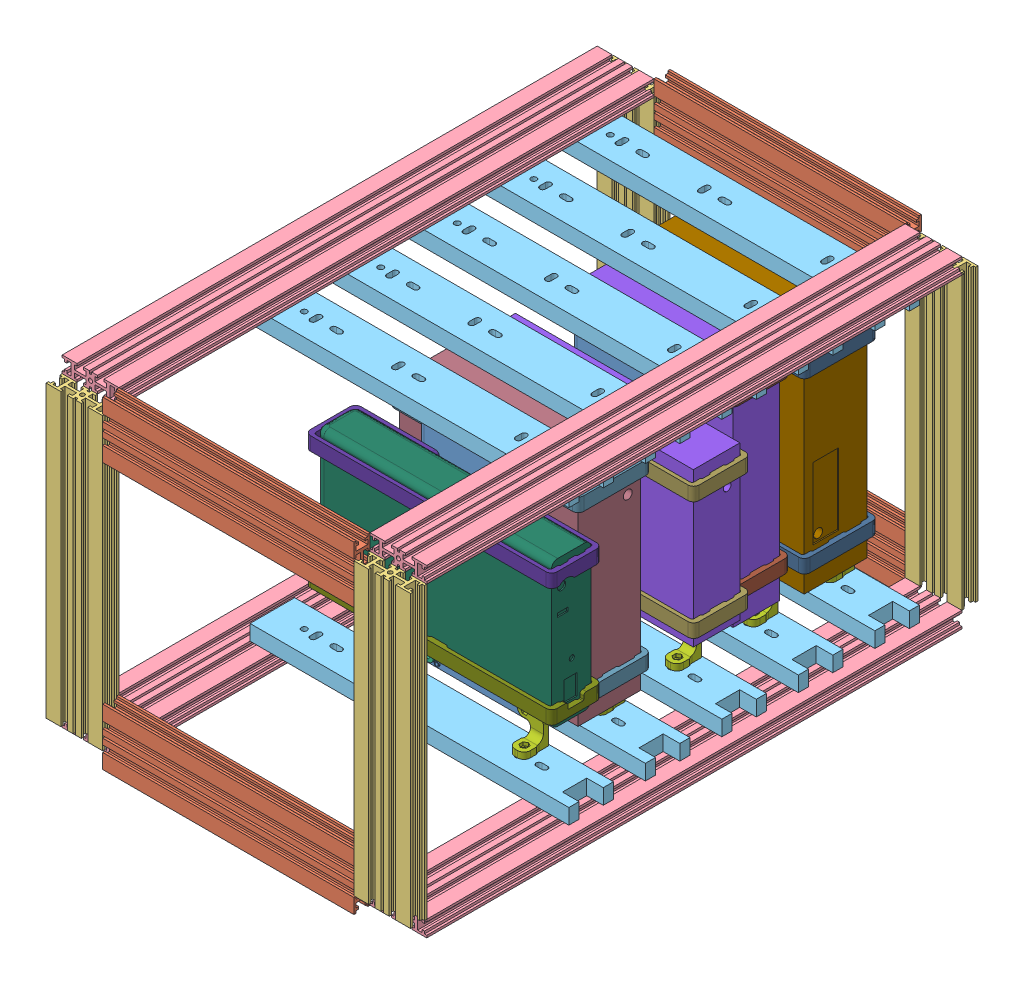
SolidWorks assembly Full ASM of Blades.SLDASM, configuration Default (file format 9000). Lengths in mm.
Overall size (285.9 253 445).
63 component instances, 17 part files, 57 mates.
Components (placement in the parent):
- Hard Fixer Panel-1: Hard Fixer Panel.SLDPRT [Default] at (220.273 500.4247 60.2249) x (-1 0 0) z (0 0 -1) size (90.2 192.2 2.2)
- Blades ASM-2: Blades ASM.SLDASM [Default] at (236.5165 485.0779 574.7555) x (0 0 -1) z (1 0 0) size (445 253 285.9)
  - Blade1-1: Blade1.SLDPRT [Default] at (114.7807 102.2962 48.6134) x (0 1 0) z (0 0 -1) size (44.45 12.7 197)
  - Blade2-1: Blade2.SLDPRT [Default] at (114.7807 111.8212 -170.6116) x (0 0 -1) z (0 -1 0) size (44.45 12.7 227.6)
  - Blade3-2: Blade3.SLDPRT [Default] at (121.1307 -122.1288 -170.6116) x (0 0 -1) z (1 0 0) size (44.45 12.7 419.6)
  - Blade3-6: Blade3.SLDPRT [Default] at (121.1307 118.1712 -170.6116) x (0 0 -1) z (1 0 0) size (44.45 12.7 419.6)
  - Blade3-7: Blade3.SLDPRT [Default] at (121.1307 -122.1288 70.8384) x (0 0 -1) z (1 0 0) size (44.45 12.7 419.6)
  - Blade3-8: Blade3.SLDPRT [Default] at (121.1307 118.1712 70.8384) x (0 0 -1) z (1 0 0) size (44.45 12.7 419.6)
  - Blade1-2: Blade1.SLDPRT [Default] at (114.7807 -106.2538 48.6134) x (0 1 0) z (0 0 -1) size (44.45 12.7 197)
  - Blade1-3: Blade1.SLDPRT [Default] at (547.0807 -106.2538 48.6134) x (0 1 0) z (0 0 -1) size (44.45 12.7 197)
  - Blade1-4: Blade1.SLDPRT [Default] at (547.0807 102.2962 48.6134) x (0 1 0) z (0 0 -1) size (44.45 12.7 197)
  - Blade2-2: Blade2.SLDPRT [Default] at (547.0807 111.8212 -170.6116) x (0 0 -1) z (0 -1 0) size (44.45 12.7 227.6)
  - Blade2-3: Blade2.SLDPRT [Default] at (114.7807 111.8212 70.8384) x (0 0 -1) z (0 -1 0) size (44.45 12.7 227.6)
  - Blade2-4: Blade2.SLDPRT [Default] at (547.0807 111.8212 70.8384) x (0 0 -1) z (0 -1 0) size (44.45 12.7 227.6)
- Rail 250-1: Rail 250.SLDPRT [Default] at (92.9686 596.8991 73.5754) x (0 0 -1) z (0 -1 0) size (35 250 12)
- Rail 250-11: Rail 250.SLDPRT [Default] at (92.9686 369.2991 79.4743) x (0 0 1) z (0 1 0) size (35 250 12)
- Panel Fixer (on rail)Part1-1: Panel Fixer (on rail)Part1.SLDPRT [Default] at (273.0864 578.6645 60.2249) size (21.2 24 20.23)
- Panel Fixer (on rail)Part1-12: Panel Fixer (on rail)Part1.SLDPRT [Default] at (163.6234 387.5337 60.2249) x (-1 0 0) z (0 0 1) size (21.2 24 20.23)
- Panel Fixer (on rail)Part2-1: Panel Fixer (on rail)Part2.SLDPRT [Default] at (176.5864 578.6645 60.2249) size (21.2 24 20.23)
- Panel Fixer (on rail)Part2-11: Panel Fixer (on rail)Part2.SLDPRT [Default] at (260.1234 387.5337 60.2249) x (-1 0 0) z (0 0 1) size (21.2 24 20.23)
- Seagate Black-1: Seagate Black.SLDPRT [Default] at (179.8327 395.0991 139.9442) x (-1 0 0) z (0 1 0) size (120.5 36.5 176)
- WD White-3T-1: WD White-3T.SLDPRT [Default] at (177.4105 398.5991 89.1799) x (-1 0 0) z (0 1 0) size (138.5 49.4 169)
- WD-3T-Part1-1: WD-3T-Part1.SLDPRT [Default] at (168.9075 510.4825 114.2249) size (146.8 10.6 58)
- Panel Fixer (on rail)Part1-13: Panel Fixer (on rail)Part1.SLDPRT [Default] at (163.6234 387.5337 120.2249) x (-1 0 0) z (0 0 1) size (21.2 24 20.23)
- Panel Fixer (on rail)Part2-12: Panel Fixer (on rail)Part2.SLDPRT [Default] at (260.1234 387.5337 120.2249) x (-1 0 0) z (0 0 1) size (21.2 24 20.23)
- Hard Fixer Panel-2: Hard Fixer Panel.SLDPRT [Default] at (220.273 500.4247 120.2249) x (-1 0 0) z (0 0 -1) size (90.2 192.2 2.2)
- Panel Fixer (on rail)Part2-4: Panel Fixer (on rail)Part2.SLDPRT [Default] at (176.5864 578.6645 120.2249) size (21.2 24 20.23)
- Panel Fixer (on rail)Part1-5: Panel Fixer (on rail)Part1.SLDPRT [Default] at (273.0864 578.6645 120.2249) size (21.2 24 20.23)
- Rail 250-12: Rail 250.SLDPRT [Default] at (92.9686 369.2991 139.4743) x (0 0 1) z (0 1 0) size (35 250 12)
- Rail 250-4: Rail 250.SLDPRT [Default] at (92.9686 596.8991 133.5754) x (0 0 -1) z (0 -1 0) size (35 250 12)
- Seagate-3T-Fixer Part1-1: Seagate-3T-Fixer Part1.SLDPRT [Default] at (160.1075 510.4825 161.2249) size (128.8 10.6 45)
- WD-3T-Part1-2: WD-3T-Part1.SLDPRT [Default] at (168.9075 377.8825 114.2249) size (146.8 10.6 58)
- Seagate-3T-Fixer Part1-2: Seagate-3T-Fixer Part1.SLDPRT [Default] at (160.1075 377.8825 161.2249) size (128.8 10.6 45)
- Rail 250-5: Rail 250.SLDPRT [Default] at (92.9686 596.8991 193.5754) x (0 0 -1) z (0 -1 0) size (35 250 12)
- Rail 250-13: Rail 250.SLDPRT [Default] at (92.9686 369.2991 199.4743) x (0 0 1) z (0 1 0) size (35 250 12)
- Panel Fixer (on rail)Part1-6: Panel Fixer (on rail)Part1.SLDPRT [Default] at (273.0864 578.6645 180.2249) size (21.2 24 20.23)
- Panel Fixer (on rail)Part2-5: Panel Fixer (on rail)Part2.SLDPRT [Default] at (176.5864 578.6645 180.2249) size (21.2 24 20.23)
- Hard Fixer Panel-3: Hard Fixer Panel.SLDPRT [Default] at (220.273 500.4247 180.2249) x (-1 0 0) z (0 0 -1) size (90.2 192.2 2.2)
- Panel Fixer (on rail)Part2-13: Panel Fixer (on rail)Part2.SLDPRT [Default] at (260.1234 387.5337 180.2249) x (-1 0 0) z (0 0 1) size (21.2 24 20.23)
- Panel Fixer (on rail)Part1-14: Panel Fixer (on rail)Part1.SLDPRT [Default] at (163.6234 387.5337 180.2249) x (-1 0 0) z (0 0 1) size (21.2 24 20.23)
- Seagate Black-2: Seagate Black.SLDPRT [Default] at (306.3411 449.2769 200.0442) x (0 -1 0) z (-1 0 0) size (120.5 36.5 176)
- Seagate-3T-Fixer Part2-1: Seagate-3T-Fixer Part2.SLDPRT [Default] at (189.0438 490.4825 221.2249) size (184.2 10.6 45)
- Seagate-3T-Fixer Part2-2: Seagate-3T-Fixer Part2.SLDPRT [Default] at (189.0438 397.6825 221.2249) size (184.2 10.6 45)
- Panel Fixer (on rail)Part1-15: Panel Fixer (on rail)Part1.SLDPRT [Default] at (163.6234 387.5337 240.2249) x (-1 0 0) z (0 0 1) size (21.2 24 20.23)
- Panel Fixer (on rail)Part1-16: Panel Fixer (on rail)Part1.SLDPRT [Default] at (163.6234 387.5337 300.2249) x (-1 0 0) z (0 0 1) size (21.2 24 20.23)
- Panel Fixer (on rail)Part2-14: Panel Fixer (on rail)Part2.SLDPRT [Default] at (260.1234 387.5337 240.2249) x (-1 0 0) z (0 0 1) size (21.2 24 20.23)
- Panel Fixer (on rail)Part2-15: Panel Fixer (on rail)Part2.SLDPRT [Default] at (260.1234 387.5337 300.2249) x (-1 0 0) z (0 0 1) size (21.2 24 20.23)
- Hard Fixer Panel-4: Hard Fixer Panel.SLDPRT [Default] at (220.273 500.4247 240.2249) x (-1 0 0) z (0 0 -1) size (90.2 192.2 2.2)
- Hard Fixer Panel-5: Hard Fixer Panel.SLDPRT [Default] at (220.273 500.4247 300.2249) x (-1 0 0) z (0 0 -1) size (90.2 192.2 2.2)
- Panel Fixer (on rail)Part2-9: Panel Fixer (on rail)Part2.SLDPRT [Default] at (176.5864 578.6645 240.2249) size (21.2 24 20.23)
- Panel Fixer (on rail)Part2-10: Panel Fixer (on rail)Part2.SLDPRT [Default] at (176.5864 578.6645 300.2249) size (21.2 24 20.23)
- Panel Fixer (on rail)Part1-10: Panel Fixer (on rail)Part1.SLDPRT [Default] at (273.0864 578.6645 240.2249) size (21.2 24 20.23)
- Panel Fixer (on rail)Part1-11: Panel Fixer (on rail)Part1.SLDPRT [Default] at (273.0864 578.6645 300.2249) size (21.2 24 20.23)
- Rail 250-14: Rail 250.SLDPRT [Default] at (92.9686 369.2991 259.4743) x (0 0 1) z (0 1 0) size (35 250 12)
- Rail 250-15: Rail 250.SLDPRT [Default] at (92.9686 369.2991 319.4743) x (0 0 1) z (0 1 0) size (35 250 12)
- Rail 250-9: Rail 250.SLDPRT [Default] at (92.9686 596.8991 253.5754) x (0 0 -1) z (0 -1 0) size (35 250 12)
- Rail 250-10: Rail 250.SLDPRT [Default] at (92.9686 596.8991 313.5754) x (0 0 -1) z (0 -1 0) size (35 250 12)
- WD Black Hard-1: WD Black Hard.SLDPRT [Default] at (248.0955 567.7557 263.9626) x (1 0 0) z (0 -1 0) size (140 49 168)
- WD Black Hard-Fixer Part1-1: WD Black Hard-Fixer Part1.SLDPRT [Default] at (171.1075 377.6825 293.8249) size (148.4 10.6 57.6)
- ROYAL ex box-1: ROYAL ex box.SLDPRT [Default] at (230.3502 481.5972 304.8249) size (185.37 114 31.73)
- WD Black Hard-Fixer Part1-2: WD Black Hard-Fixer Part1.SLDPRT [Default] at (171.1075 510.4825 293.8249) size (148.4 10.6 57.6)
- Royal ex-Part1-1: Royal ex-Part1.SLDPRT [Default] at (192.3075 397.6825 335.8249) size (193.4 10.6 39.6)
- Royal ex-Part2-1: Royal ex-Part2.SLDPRT [Default] at (192.3075 490.4825 335.8249) size (193.4 10.6 39.6)
Mates (geometry in assembly coordinates):
- Coincident1: coincident: line of Blades ASM-2/Blade3-6 through (71.4049 596.8991 34.0249) axis (0 0 1); plane of Rail 250-1 through (71.4049 584.8991 94.0249) normal (-1 0 0)
- Coincident2: coincident anti-aligned: plane of Blades ASM-2/Blade3-6 through (88.1299 596.8991 34.0249) normal (0 -1 0); plane of Rail 250-1 through (92.9686 596.8991 73.5754) normal (0 1 0)
- Coincident3: coincident aligned: plane of Rail 250-1 through (71.4049 584.8991 94.0249) normal (-1 0 0); plane of Rail 250-11 through (71.4049 381.2991 59.0249) normal (-1 0 0)
- Coincident4: coincident aligned: plane of Rail 250-1 through (321.4049 584.8991 94.0249) normal (0 0 1); plane of Rail 250-11 through (321.4049 381.2991 94.0249) normal (0 0 1)
- Coincident5: coincident anti-aligned: plane of Blades ASM-2/Blade3-2 through (76.5049 369.2991 34.0249) normal (0 1 0); plane of Rail 250-11 through (92.9686 369.2991 79.4743) normal (0 -1 0)
- Coincident6: coincident aligned: plane of Hard Fixer Panel-1 through (220.273 500.4247 59.0249) normal (0 0 -1); plane of Rail 250-1 through (321.4049 584.8991 59.0249) normal (0 0 -1)
- Distance1: distance = 25 mm anti-aligned: plane of Blades ASM-2/Blade2-2 through (88.1299 369.2991 34.0249) normal (0 0 1); plane of Rail 250-1 through (321.4049 584.8991 59.0249) normal (0 0 -1)
- Coincident7: coincident anti-aligned: plane of Hard Fixer Panel-1 through (220.273 500.4247 60.2249) normal (0 0 1); plane of Panel Fixer (on rail)Part1-1 through (273.0864 578.6645 60.2249) normal (0 0 -1)
- Coincident8: coincident anti-aligned: plane of Rail 250-1 through (92.9686 584.8991 73.5754) normal (0 -1 0); plane of Panel Fixer (on rail)Part1-1 through (261.6049 584.8991 64.2249) normal (0 1 0)
- Distance2: distance = 5 mm: plane of Panel Fixer (on rail)Part1-1 through (261.6049 584.8991 64.2249) normal (-1 0 0); point of Rail 250-1
- Coincident11: coincident anti-aligned: plane of Rail 250-11 through (92.9686 381.2991 79.4743) normal (0 1 0); plane of Panel Fixer (on rail)Part1-12 through (175.1049 381.2991 64.2249) normal (0 -1 0)
- Coincident12: coincident anti-aligned: plane of Hard Fixer Panel-1 through (220.273 500.4247 60.2249) normal (0 0 1); plane of Panel Fixer (on rail)Part1-12 through (163.6234 387.5337 60.2249) normal (0 0 -1)
- Distance4: distance = 5 mm: point of Rail 250-11; plane of Panel Fixer (on rail)Part1-12 through (175.1049 381.2991 64.2249) normal (1 0 0)
- Distance6: distance = 18.9 mm: point of Hard Fixer Panel-1; plane of Rail 250-1 through (92.9686 584.8991 73.5754) normal (0 -1 0)
- Parallel1: parallel aligned: plane of Hard Fixer Panel-1 through (262.1049 582.9991 59.0249) normal (1 0 0); plane of Rail 250-1 through (321.4049 584.8991 94.0249) normal (1 0 0)
- Distance9: distance = 4.9 mm: plane of Panel Fixer (on rail)Part1-1 through (261.6049 584.8991 64.2249) normal (-1 0 0); point of Hard Fixer Panel-1
- Coincident13: coincident anti-aligned: plane of Rail 250-1 through (92.9686 584.8991 73.5754) normal (0 -1 0); plane of Panel Fixer (on rail)Part2-1 through (165.1049 584.8991 64.2249) normal (0 1 0)
- Coincident14: coincident anti-aligned: plane of Hard Fixer Panel-1 through (220.273 500.4247 60.2249) normal (0 0 1); plane of Panel Fixer (on rail)Part2-1 through (176.5864 578.6645 60.2249) normal (0 0 -1)
- Distance10: distance = 5 mm: point of Rail 250-1; plane of Panel Fixer (on rail)Part2-1 through (165.1049 584.8991 64.2249) normal (-1 0 0)
- Coincident15: coincident anti-aligned: plane of Rail 250-11 through (92.9686 381.2991 79.4743) normal (0 1 0); plane of Panel Fixer (on rail)Part2-11 through (271.6049 381.2991 64.2249) normal (0 -1 0)
- Coincident16: coincident anti-aligned: plane of Hard Fixer Panel-1 through (220.273 500.4247 60.2249) normal (0 0 1); plane of Panel Fixer (on rail)Part2-11 through (260.1234 387.5337 60.2249) normal (0 0 -1)
- Distance11: distance = 5 mm: plane of Panel Fixer (on rail)Part2-11 through (271.6049 381.2991 64.2249) normal (1 0 0); point of Rail 250-11
- Distance12: distance = 17.3 mm anti-aligned: plane of WD White-3T-1 through (177.4105 398.5991 89.1799) normal (0 -1 0); plane of Rail 250-11 through (92.9686 381.2991 79.4743) normal (0 1 0)
- Distance13: distance = 24 mm aligned: plane of WD White-3T-1 through (286.1049 567.5991 114.2249) normal (1 0 0); plane of Hard Fixer Panel-1 through (262.1049 582.9991 59.0249) normal (1 0 0)
- Coincident21: coincident anti-aligned: plane of WD White-3T-1 through (286.1049 567.5991 114.2249) normal (0 0 1); plane of WD-3T-Part1-1 through (168.9075 510.4825 114.2249) normal (0 0 -1)
- Distance15: distance = 4.2 mm aligned: plane of WD-3T-Part1-1 through (290.3049 558.2991 118.2249) normal (1 0 0); plane of WD White-3T-1 through (286.1049 567.5991 114.2249) normal (1 0 0)
- Coincident24: coincident anti-aligned: plane of Hard Fixer Panel-1 through (220.273 500.4247 60.2249) normal (0 0 1); plane of WD-3T-Part1-1 through (168.9075 510.4825 60.2249) normal (0 0 -1)
- Distance18: distance = 13.8 mm anti-aligned: plane of Seagate Black-1 through (179.8327 571.0991 139.9442) normal (0 1 0); plane of Rail 250-4 through (92.9686 584.8991 133.5754) normal (0 -1 0)
- Distance19: distance = 15 mm aligned: plane of Seagate Black-1 through (156.9049 571.0991 161.2249) normal (-1 0 0); plane of Hard Fixer Panel-2 through (171.9049 582.9991 119.0249) normal (-1 0 0)
- Distance20: distance = 24.7 mm aligned: plane of Hard Fixer Panel-1 through (262.1049 582.9991 59.0249) normal (0 1 0); plane of WD-3T-Part1-1 through (143.5049 558.2991 118.2249) normal (0 1 0)
- Coincident25: coincident aligned: plane of WD-3T-Part1-1 through (143.5049 558.2991 118.2249) normal (0 1 0); plane of Seagate-3T-Fixer Part1-1 through (152.7049 558.2991 165.2249) normal (0 1 0)
- Coincident26: coincident anti-aligned: plane of Hard Fixer Panel-2 through (220.273 500.4247 120.2249) normal (0 0 1); plane of Seagate-3T-Fixer Part1-1 through (160.1075 510.4825 120.2249) normal (0 0 -1)
- Coincident27: coincident anti-aligned: plane of Seagate Black-1 through (277.4049 571.0991 161.2249) normal (0 0 1); plane of Seagate-3T-Fixer Part1-1 through (160.1075 510.4825 161.2249) normal (0 0 -1)
- Distance21: distance = 0.1 mm anti-aligned: plane of Seagate Black-1 through (277.4049 571.0991 161.2249) normal (1 0 0); plane of Seagate-3T-Fixer Part1-1 through (277.5049 547.6991 120.2249) normal (-1 0 0)
- Coincident28: coincident anti-aligned: plane of Hard Fixer Panel-3 through (220.273 500.4247 180.2249) normal (0 0 1); plane of Seagate-3T-Fixer Part2-1 through (189.0438 490.4825 180.2249) normal (0 0 -1)
- Concentric1: concentric anti-aligned: circle of Hard Fixer Panel-3; circle of Seagate-3T-Fixer Part2-1
- Distance22: distance = 0.2 mm anti-aligned: plane of Seagate Black-2 through (130.3411 546.8491 184.8249) normal (0 0 -1); plane of Seagate-3T-Fixer Part2-1 through (130.2411 527.6991 184.6249) normal (0 0 1)
- Distance24: distance = 0.1 mm anti-aligned: plane of Seagate Black-2 through (130.3411 449.2769 200.0442) normal (-1 0 0); plane of Seagate-3T-Fixer Part2-1 through (130.2411 527.6991 180.2249) normal (1 0 0)
- Parallel2: parallel aligned: plane of Rail 250-5 through (92.9686 596.8991 193.5754) normal (0 1 0); plane of Seagate-3T-Fixer Part2-1 through (126.2411 538.2991 225.2249) normal (0 1 0)
- Coincident29: coincident aligned: plane of Seagate-3T-Fixer Part2-1 through (189.0438 490.4825 225.2249) normal (0 0 1); plane of Seagate-3T-Fixer Part2-2 through (189.0438 397.6825 225.2249) normal (0 0 1)
- Coincident30: coincident aligned: plane of Seagate-3T-Fixer Part2-1 through (126.2411 538.2991 225.2249) normal (-1 0 0); plane of Seagate-3T-Fixer Part2-2 through (126.2411 445.4991 225.2249) normal (-1 0 0)
- Concentric2: concentric aligned: circle of Hard Fixer Panel-3; circle of Seagate-3T-Fixer Part2-2
- Distance25: distance = 8.55 mm aligned: plane of Seagate Black-2 through (130.3411 546.8491 221.3249) normal (0 1 0); plane of Seagate-3T-Fixer Part2-1 through (126.2411 538.2991 225.2249) normal (0 1 0)
- Distance26: distance = 0.2 mm anti-aligned: plane of WD Black Hard-Fixer Part1-1 through (288.5049 414.8991 244.6249) normal (0 0 1); plane of WD Black Hard-1 through (148.4049 399.7557 244.8249) normal (0 0 -1)
- Distance27: distance = 0.1 mm anti-aligned: plane of WD Black Hard-1 through (288.4049 399.7557 293.8249) normal (1 0 0); plane of WD Black Hard-Fixer Part1-1 through (288.5049 414.8991 240.2249) normal (-1 0 0)
- Concentric3: concentric aligned: circle of Hard Fixer Panel-4; circle of WD Black Hard-Fixer Part1-1
- Coincident31: coincident anti-aligned: plane of Hard Fixer Panel-4 through (220.273 500.4247 240.2249) normal (0 0 1); plane of WD Black Hard-Fixer Part1-1 through (171.1075 377.6825 240.2249) normal (0 0 -1)
- Coincident32: coincident anti-aligned: plane of Hard Fixer Panel-4 through (220.273 500.4247 240.2249) normal (0 0 1); plane of WD Black Hard-Fixer Part1-1 through (171.1075 377.6825 240.2249) normal (0 0 -1)
- Distance29: distance = 42 mm anti-aligned: plane of Rail 250-10 through (92.9686 584.8991 313.5754) normal (0 -1 0); plane of ROYAL ex box-1 through (124.5049 542.8991 335.8249) normal (0 1 0)
- Distance30: distance = 47.4 mm aligned: plane of ROYAL ex box-1 through (124.5049 542.8991 335.8249) normal (-1 0 0); plane of Hard Fixer Panel-5 through (171.9049 582.9991 299.0249) normal (-1 0 0)
- Distance31: distance = 5.8 mm aligned: plane of Hard Fixer Panel-5 through (220.273 500.4247 299.0249) normal (0 0 -1); plane of ROYAL ex box-1 through (230.3502 481.5972 304.8249) normal (0 0 -1)
- Coincident33: coincident anti-aligned: plane of ROYAL ex box-1 through (230.3502 481.5972 335.8249) normal (0 0 1); plane of Royal ex-Part1-1 through (192.3075 397.6825 335.8249) normal (0 0 -1)
- Distance32: distance = 0.2 mm anti-aligned: plane of Royal ex-Part1-1 through (124.3049 434.8991 300.2249) normal (1 0 0); plane of ROYAL ex box-1 through (124.5049 542.8991 335.8249) normal (-1 0 0)
- Distance33: distance = 53.6 mm anti-aligned: plane of Royal ex-Part1-1 through (120.3049 434.8991 339.8249) normal (0 -1 0); plane of Rail 250-15 through (92.9686 381.2991 319.4743) normal (0 1 0)
- Coincident34: coincident aligned: plane of Royal ex-Part1-1 through (313.7049 445.4991 339.8249) normal (1 0 0); plane of Royal ex-Part2-1 through (313.7049 538.2991 339.8249) normal (1 0 0)
- Coincident35: coincident aligned: plane of Royal ex-Part1-1 through (192.3075 397.6825 339.8249) normal (0 0 1); plane of Royal ex-Part2-1 through (192.3075 490.4825 339.8249) normal (0 0 1)
- Distance34: distance = 46.6 mm anti-aligned: plane of Rail 250-10 through (92.9686 584.8991 313.5754) normal (0 -1 0); plane of Royal ex-Part2-1 through (120.3049 538.2991 339.8249) normal (0 1 0)
